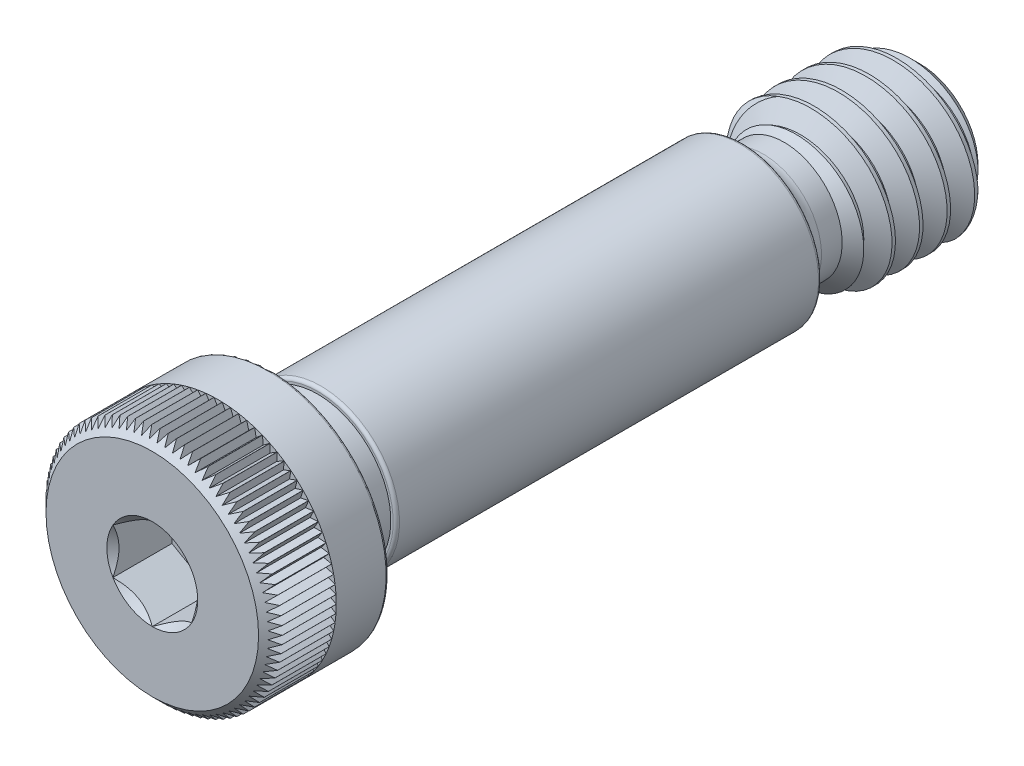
from build123d import *

# Parameters (mm, degrees)
CUT_EXTRUDE2_DEPTH     = 1.5
CUT_SWEEP1_PITCH       = 0.7
CUT_SWEEP1_HEIGHT      = 4.5
CUT_SWEEP1_RADIUS      = 2
CUT_SWEEP1_START_ANGLE = 90
CUT_EXTRUDE5_START     = -1.3125
CUT_EXTRUDE5_DEPTH     = 21.917081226
CIRPATTERN1_COUNT      = 90


with BuildPart() as part:
    # Sketch12 → Revolve1 (revolve)
    with BuildSketch(Plane(origin=(0, 0, 0), x_dir=(0, 0, -1), z_dir=(1, 0, 0)), mode=Mode.PRIVATE) as revolve1_sk:
        with BuildLine():
            Line((-9.75, 0), (-9.75, 2.7))
            Line((-9.75, 2.7), (-9.45, 3))
            Line((-9.45, 3), (-6.81, 3))
            ThreePointArc((-6.81, 3), (-6.767573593, 2.982426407), (-6.75, 2.94))
            Line((-6.75, 2.94), (-6.75, 1.86))
            Line((-6.75, 1.86), (-5.55, 1.86))
            Line((-5.55, 1.86), (-5.55, 1.92))
            ThreePointArc((-5.55, 1.92), (-5.526568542, 1.976568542), (-5.47, 2))
            Line((-5.47, 2), (5.175312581, 2))
            ThreePointArc((5.175312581, 2), (5.228008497, 1.980192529), (5.254610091, 1.930578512))
            ThreePointArc((5.254610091, 1.930578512), (5.429183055, 1.604986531), (5.775, 1.475))
            Line((5.775, 1.475), (6.3, 1.475))
            Line((6.3, 1.475), (6.825, 2))
            Line((6.825, 2), (9.225, 2))
            Line((9.225, 2), (9.75, 1.475))
            Line((9.75, 1.475), (9.75, 0))
            Line((9.75, 0), (-9.75, 0))
        make_face()
    revolve(revolve1_sk.sketch.rotate(Axis((0, 0, -9.75), (0, 0, 1)), 90), axis=Axis((0, 0, -9.75), (0, 0, 1)))

    # Sketch8 → Cut-Extrude2 (cut)
    with BuildSketch(Plane.XY.offset(9.75)):
        Polygon((0, -1.154700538), (1, -0.577350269), (1, 0.577350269), (0, 1.154700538), (-1, 0.577350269), (-1, -0.577350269), align=None)
    extrude(amount=-CUT_EXTRUDE2_DEPTH, mode=Mode.SUBTRACT)

    # Cut-Extrude4 cone 1 section (on through the dimple's axis) → Cut-Extrude4 (revolve, cut)
    with BuildSketch(Plane(origin=(0, 0, 9.75), x_dir=(0, -1, 0), z_dir=(1, 0, 0))):
        Polygon((0, 0), (1.154700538, 0), (0, 1.154700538), align=None)
    revolve(axis=Axis((0, 0, 9.75), (0, 0, -1)), mode=Mode.SUBTRACT)


with BuildPart() as body_2:
    # Split1: the piece on the far side of the plane
    add(part.part)
    split(bisect_by=Plane(origin=(0, 0, -6.3), x_dir=(0, -1, 0), z_dir=(0, 0, -1)), keep=Keep.BOTTOM)


with BuildPart() as part_1:
    add(part.part)

    # Split1
    split(bisect_by=Plane(origin=(0, 0, -6.3), x_dir=(0, -1, 0), z_dir=(0, 0, -1)), keep=Keep.TOP)

    # Cut-Sweep1: sweep along a helix
    with BuildLine() as cut_sweep1_path:
        add(Helix(CUT_SWEEP1_PITCH, CUT_SWEEP1_HEIGHT, CUT_SWEEP1_RADIUS, center=(0, 0, -9.75), direction=(0, 0, 1), mode=Mode.PRIVATE).rotate(Axis((0, 0, -9.75), (0, 0, 1)), CUT_SWEEP1_START_ANGLE))
    # Sketch13 → Cut-Sweep1 (sweep, cut)
    with BuildSketch(Plane(origin=(0, 0, 0), x_dir=(0, 0, -1), z_dir=(1, 0, 0))):
        Polygon((9.728125, 2.037888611), (10.384375, 2.037888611), (10.1, 1.545336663), (10.0125, 1.545336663), align=None)
    sweep(path=cut_sweep1_path.line, is_frenet=True, mode=Mode.SUBTRACT)


with BuildPart() as body_2_1:
    add(body_2.part)

    # Combine1: union part
    add(part_1.part)

    # Sketch11 → Cut-Extrude5 (cut)
    with BuildSketch(Plane.XY.offset(9.39).offset(CUT_EXTRUDE5_START)):
        Polygon((0.104762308, 3), (0, 2.818546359), (-0.104762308, 3), align=None)
    cut_extrude5 = extrude(amount=CUT_EXTRUDE5_DEPTH, mode=Mode.SUBTRACT)

    # CirPattern1: Cut-Extrude5 ×90 about axis
    cirpattern1_axis = Axis((0, 0, 0), (0, 0, 1))
    for i in range(1, CIRPATTERN1_COUNT):
        add(cut_extrude5.rotate(cirpattern1_axis, i * 360 / CIRPATTERN1_COUNT), mode=Mode.SUBTRACT)


solid = body_2_1.part
